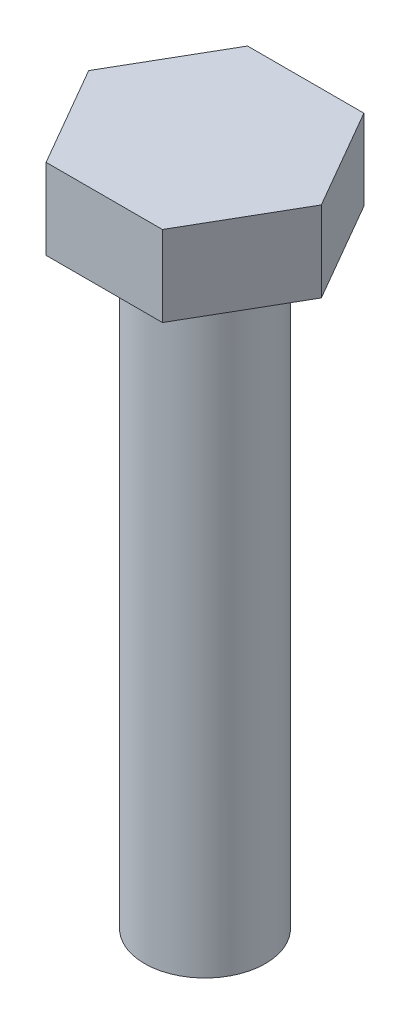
from build123d import *

# Parameters (mm, degrees)
BOSS_EXTRU_1_DEPTH = 4
ESQUISSE2_R        = 3
BOSS_EXTRU_2_DEPTH = 30


with BuildPart() as part:
    # Esquisse1 → Boss.-Extru.1 (new body)
    with BuildSketch(Plane(origin=(0, 0, 0), x_dir=(1, 0, 0), z_dir=(0, 1, 0))):
        Polygon((5.773502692, 0), (2.886751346, 5), (-2.886751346, 5), (-5.773502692, 0), (-2.886751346, -5), (2.886751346, -5), align=None)
    extrude(amount=BOSS_EXTRU_1_DEPTH)

    # Esquisse2 → Boss.-Extru.2 (add)
    with BuildSketch(Plane.XZ):
        with Locations(Location((0, 0, 0), (0, 0, 90))):
            Circle(ESQUISSE2_R)
    extrude(amount=BOSS_EXTRU_2_DEPTH)


solid = part.part
